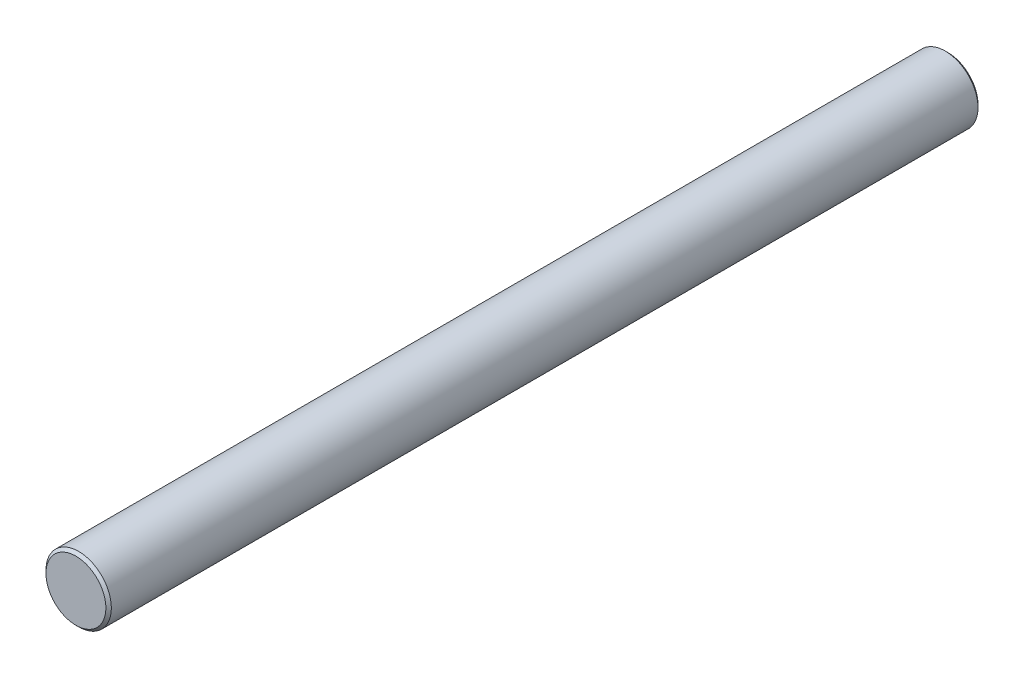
ISO-10303-21;
HEADER;
FILE_DESCRIPTION(('STEP AP214'),'2;1');
FILE_NAME('part.step','',(''),(''),'','','');
FILE_SCHEMA(('AUTOMOTIVE_DESIGN { 1 0 10303 214 1 1 1 1 }'));
ENDSEC;
DATA;
#1=APPLICATION_CONTEXT('core data for automotive mechanical design processes');
#2=APPLICATION_PROTOCOL_DEFINITION('international standard','automotive_design',2000,#1);
#3=PRODUCT_CONTEXT('',#1,'mechanical');
#4=PRODUCT('Part','Part','',(#3));
#5=PRODUCT_RELATED_PRODUCT_CATEGORY('part','',(#4));
#6=PRODUCT_DEFINITION_FORMATION('','',#4);
#7=PRODUCT_DEFINITION_CONTEXT('part definition',#1,'design');
#8=PRODUCT_DEFINITION('design','',#6,#7);
#9=PRODUCT_DEFINITION_SHAPE('','',#8);
#10=(LENGTH_UNIT() NAMED_UNIT(*) SI_UNIT(.MILLI.,.METRE.));
#11=(NAMED_UNIT(*) PLANE_ANGLE_UNIT() SI_UNIT($,.RADIAN.));
#12=(NAMED_UNIT(*) SI_UNIT($,.STERADIAN.) SOLID_ANGLE_UNIT());
#13=UNCERTAINTY_MEASURE_WITH_UNIT(LENGTH_MEASURE(1.E-05),#10,'distance_accuracy_value','');
#14=(GEOMETRIC_REPRESENTATION_CONTEXT(3) GLOBAL_UNCERTAINTY_ASSIGNED_CONTEXT((#13)) GLOBAL_UNIT_ASSIGNED_CONTEXT((#10,
#11,#12)) REPRESENTATION_CONTEXT('',''));
#15=CARTESIAN_POINT('',(0.,0.,0.));
#16=DIRECTION('',(0.,0.,1.));
#17=DIRECTION('',(1.,0.,0.));
#18=AXIS2_PLACEMENT_3D('',#15,#16,#17);
#19=CARTESIAN_POINT('',(0.,0.,80.));
#20=DIRECTION('',(0.,0.,-1.));
#21=DIRECTION('',(-1.,0.,0.));
#22=AXIS2_PLACEMENT_3D('',#19,#20,#21);
#23=CYLINDRICAL_SURFACE('',#22,3.);
#24=CARTESIAN_POINT('',(0.,0.,0.249999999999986));
#25=DIRECTION('',(0.,0.,1.));
#26=DIRECTION('',(1.,0.,0.));
#27=AXIS2_PLACEMENT_3D('',#24,#25,#26);
#28=CIRCLE('',#27,3.);
#29=CARTESIAN_POINT('',(3.,0.,0.249999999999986));
#30=VERTEX_POINT('',#29);
#31=EDGE_CURVE('E40',#30,#30,#28,.T.);
#32=ORIENTED_EDGE('',*,*,#31,.T.);
#33=EDGE_LOOP('',(#32));
#34=FACE_BOUND('',#33,.T.);
#35=CARTESIAN_POINT('',(0.,0.,79.75));
#36=DIRECTION('',(0.,0.,1.));
#37=DIRECTION('',(1.,0.,0.));
#38=AXIS2_PLACEMENT_3D('',#35,#36,#37);
#39=CIRCLE('',#38,3.);
#40=CARTESIAN_POINT('',(3.,0.,79.75));
#41=VERTEX_POINT('',#40);
#42=EDGE_CURVE('E44',#41,#41,#39,.F.);
#43=ORIENTED_EDGE('',*,*,#42,.T.);
#44=EDGE_LOOP('',(#43));
#45=FACE_BOUND('',#44,.T.);
#46=ADVANCED_FACE('F29',(#34,#45),#23,.T.);
#47=CARTESIAN_POINT('',(0.,0.,80.));
#48=DIRECTION('',(0.,0.,1.));
#49=DIRECTION('',(1.,0.,0.));
#50=AXIS2_PLACEMENT_3D('',#47,#48,#49);
#51=PLANE('',#50);
#52=CARTESIAN_POINT('',(0.,0.,80.));
#53=DIRECTION('',(0.,0.,1.));
#54=DIRECTION('',(1.,0.,0.));
#55=AXIS2_PLACEMENT_3D('',#52,#53,#54);
#56=CIRCLE('',#55,2.75000000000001);
#57=CARTESIAN_POINT('',(2.75000000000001,0.,80.));
#58=VERTEX_POINT('',#57);
#59=EDGE_CURVE('E10',#58,#58,#56,.T.);
#60=ORIENTED_EDGE('',*,*,#59,.T.);
#61=EDGE_LOOP('',(#60));
#62=FACE_BOUND('',#61,.T.);
#63=ADVANCED_FACE('F60',(#62),#51,.T.);
#64=CARTESIAN_POINT('',(0.,0.,0.));
#65=DIRECTION('',(0.,0.,1.));
#66=DIRECTION('',(1.,0.,0.));
#67=AXIS2_PLACEMENT_3D('',#64,#65,#66);
#68=PLANE('',#67);
#69=CARTESIAN_POINT('',(0.,0.,0.));
#70=DIRECTION('',(0.,0.,1.));
#71=DIRECTION('',(1.,0.,0.));
#72=AXIS2_PLACEMENT_3D('',#69,#70,#71);
#73=CIRCLE('',#72,2.75000000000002);
#74=CARTESIAN_POINT('',(2.75000000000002,0.,0.));
#75=VERTEX_POINT('',#74);
#76=EDGE_CURVE('E36',#75,#75,#73,.F.);
#77=ORIENTED_EDGE('',*,*,#76,.T.);
#78=EDGE_LOOP('',(#77));
#79=FACE_BOUND('',#78,.T.);
#80=ADVANCED_FACE('F57',(#79),#68,.F.);
#81=CARTESIAN_POINT('',(0.,0.,0.249999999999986));
#82=DIRECTION('',(0.,0.,1.));
#83=DIRECTION('',(1.,0.,0.));
#84=AXIS2_PLACEMENT_3D('',#81,#82,#83);
#85=CONICAL_SURFACE('',#84,3.,0.785398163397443);
#86=ORIENTED_EDGE('',*,*,#76,.F.);
#87=EDGE_LOOP('',(#86));
#88=FACE_BOUND('',#87,.T.);
#89=ORIENTED_EDGE('',*,*,#31,.F.);
#90=EDGE_LOOP('',(#89));
#91=FACE_BOUND('',#90,.T.);
#92=ADVANCED_FACE('F53',(#88,#91),#85,.T.);
#93=CARTESIAN_POINT('',(0.,0.,80.));
#94=DIRECTION('',(0.,0.,-1.));
#95=DIRECTION('',(-1.,0.,0.));
#96=AXIS2_PLACEMENT_3D('',#93,#94,#95);
#97=CONICAL_SURFACE('',#96,2.75000000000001,0.78539816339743);
#98=ORIENTED_EDGE('',*,*,#42,.F.);
#99=EDGE_LOOP('',(#98));
#100=FACE_BOUND('',#99,.T.);
#101=ORIENTED_EDGE('',*,*,#59,.F.);
#102=EDGE_LOOP('',(#101));
#103=FACE_BOUND('',#102,.T.);
#104=ADVANCED_FACE('F31',(#100,#103),#97,.T.);
#105=CLOSED_SHELL('',(#46,#63,#80,#92,#104));
#106=MANIFOLD_SOLID_BREP('B2',#105);
#107=ADVANCED_BREP_SHAPE_REPRESENTATION('',(#18,#106),#14);
#108=SHAPE_DEFINITION_REPRESENTATION(#9,#107);
ENDSEC;
END-ISO-10303-21;
